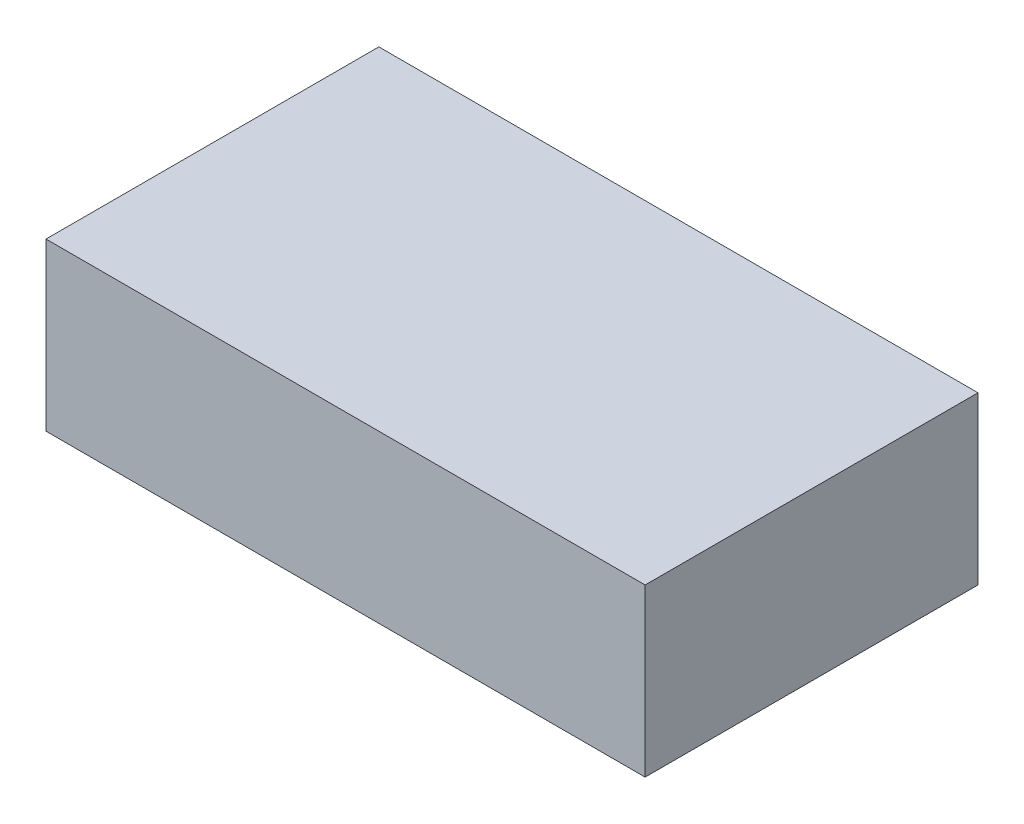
ISO-10303-21;
HEADER;
FILE_DESCRIPTION(('STEP AP214'),'2;1');
FILE_NAME('part.step','',(''),(''),'','','');
FILE_SCHEMA(('AUTOMOTIVE_DESIGN { 1 0 10303 214 1 1 1 1 }'));
ENDSEC;
DATA;
#1=APPLICATION_CONTEXT('core data for automotive mechanical design processes');
#2=APPLICATION_PROTOCOL_DEFINITION('international standard','automotive_design',2000,#1);
#3=PRODUCT_CONTEXT('',#1,'mechanical');
#4=PRODUCT('Part','Part','',(#3));
#5=PRODUCT_RELATED_PRODUCT_CATEGORY('part','',(#4));
#6=PRODUCT_DEFINITION_FORMATION('','',#4);
#7=PRODUCT_DEFINITION_CONTEXT('part definition',#1,'design');
#8=PRODUCT_DEFINITION('design','',#6,#7);
#9=PRODUCT_DEFINITION_SHAPE('','',#8);
#10=(LENGTH_UNIT() NAMED_UNIT(*) SI_UNIT(.MILLI.,.METRE.));
#11=(NAMED_UNIT(*) PLANE_ANGLE_UNIT() SI_UNIT($,.RADIAN.));
#12=(NAMED_UNIT(*) SI_UNIT($,.STERADIAN.) SOLID_ANGLE_UNIT());
#13=UNCERTAINTY_MEASURE_WITH_UNIT(LENGTH_MEASURE(1.E-05),#10,'distance_accuracy_value','');
#14=(GEOMETRIC_REPRESENTATION_CONTEXT(3) GLOBAL_UNCERTAINTY_ASSIGNED_CONTEXT((#13)) GLOBAL_UNIT_ASSIGNED_CONTEXT((#10,
#11,#12)) REPRESENTATION_CONTEXT('',''));
#15=CARTESIAN_POINT('',(0.,0.,0.));
#16=DIRECTION('',(0.,0.,1.));
#17=DIRECTION('',(1.,0.,0.));
#18=AXIS2_PLACEMENT_3D('',#15,#16,#17);
#19=CARTESIAN_POINT('',(0.,-25.,0.));
#20=DIRECTION('',(-1.,0.,0.));
#21=DIRECTION('',(0.,0.,1.));
#22=AXIS2_PLACEMENT_3D('',#19,#20,#21);
#23=PLANE('',#22);
#24=DIRECTION('',(0.,0.,1.));
#25=VECTOR('',#24,1.);
#26=CARTESIAN_POINT('',(0.,0.,0.));
#27=LINE('',#26,#25);
#28=CARTESIAN_POINT('',(0.,0.,-50.));
#29=VERTEX_POINT('',#28);
#30=CARTESIAN_POINT('',(0.,0.,0.));
#31=VERTEX_POINT('',#30);
#32=EDGE_CURVE('E103',#29,#31,#27,.T.);
#33=ORIENTED_EDGE('',*,*,#32,.F.);
#34=DIRECTION('',(0.,1.,0.));
#35=VECTOR('',#34,1.);
#36=CARTESIAN_POINT('',(0.,-25.,-50.));
#37=LINE('',#36,#35);
#38=CARTESIAN_POINT('',(0.,-25.,-50.));
#39=VERTEX_POINT('',#38);
#40=EDGE_CURVE('E11',#39,#29,#37,.T.);
#41=ORIENTED_EDGE('',*,*,#40,.F.);
#42=DIRECTION('',(0.,0.,1.));
#43=VECTOR('',#42,1.);
#44=CARTESIAN_POINT('',(0.,-25.,0.));
#45=LINE('',#44,#43);
#46=CARTESIAN_POINT('',(0.,-25.,0.));
#47=VERTEX_POINT('',#46);
#48=EDGE_CURVE('E100',#39,#47,#45,.T.);
#49=ORIENTED_EDGE('',*,*,#48,.T.);
#50=DIRECTION('',(0.,1.,0.));
#51=VECTOR('',#50,1.);
#52=CARTESIAN_POINT('',(0.,-25.,0.));
#53=LINE('',#52,#51);
#54=EDGE_CURVE('E45',#47,#31,#53,.T.);
#55=ORIENTED_EDGE('',*,*,#54,.T.);
#56=EDGE_LOOP('',(#33,#41,#49,#55));
#57=FACE_BOUND('',#56,.T.);
#58=ADVANCED_FACE('F39',(#57),#23,.T.);
#59=CARTESIAN_POINT('',(0.,-25.,-50.));
#60=DIRECTION('',(0.,0.,-1.));
#61=DIRECTION('',(-1.,0.,0.));
#62=AXIS2_PLACEMENT_3D('',#59,#60,#61);
#63=PLANE('',#62);
#64=DIRECTION('',(-1.,0.,0.));
#65=VECTOR('',#64,1.);
#66=CARTESIAN_POINT('',(0.,0.,-50.));
#67=LINE('',#66,#65);
#68=CARTESIAN_POINT('',(90.,0.,-50.));
#69=VERTEX_POINT('',#68);
#70=EDGE_CURVE('E97',#69,#29,#67,.T.);
#71=ORIENTED_EDGE('',*,*,#70,.F.);
#72=DIRECTION('',(0.,1.,0.));
#73=VECTOR('',#72,1.);
#74=CARTESIAN_POINT('',(90.,-25.,-50.));
#75=LINE('',#74,#73);
#76=CARTESIAN_POINT('',(90.,-25.,-50.));
#77=VERTEX_POINT('',#76);
#78=EDGE_CURVE('E48',#77,#69,#75,.T.);
#79=ORIENTED_EDGE('',*,*,#78,.F.);
#80=DIRECTION('',(-1.,0.,0.));
#81=VECTOR('',#80,1.);
#82=CARTESIAN_POINT('',(0.,-25.,-50.));
#83=LINE('',#82,#81);
#84=EDGE_CURVE('E94',#77,#39,#83,.T.);
#85=ORIENTED_EDGE('',*,*,#84,.T.);
#86=ORIENTED_EDGE('',*,*,#40,.T.);
#87=EDGE_LOOP('',(#71,#79,#85,#86));
#88=FACE_BOUND('',#87,.T.);
#89=ADVANCED_FACE('F114',(#88),#63,.T.);
#90=CARTESIAN_POINT('',(90.,-25.,0.));
#91=DIRECTION('',(1.,0.,0.));
#92=DIRECTION('',(0.,0.,-1.));
#93=AXIS2_PLACEMENT_3D('',#90,#91,#92);
#94=PLANE('',#93);
#95=DIRECTION('',(0.,0.,-1.));
#96=VECTOR('',#95,1.);
#97=CARTESIAN_POINT('',(90.,0.,0.));
#98=LINE('',#97,#96);
#99=CARTESIAN_POINT('',(90.,0.,0.));
#100=VERTEX_POINT('',#99);
#101=EDGE_CURVE('E90',#100,#69,#98,.T.);
#102=ORIENTED_EDGE('',*,*,#101,.F.);
#103=DIRECTION('',(0.,1.,0.));
#104=VECTOR('',#103,1.);
#105=CARTESIAN_POINT('',(90.,-25.,0.));
#106=LINE('',#105,#104);
#107=CARTESIAN_POINT('',(90.,-25.,0.));
#108=VERTEX_POINT('',#107);
#109=EDGE_CURVE('E81',#108,#100,#106,.T.);
#110=ORIENTED_EDGE('',*,*,#109,.F.);
#111=DIRECTION('',(0.,0.,-1.));
#112=VECTOR('',#111,1.);
#113=CARTESIAN_POINT('',(90.,-25.,0.));
#114=LINE('',#113,#112);
#115=EDGE_CURVE('E87',#108,#77,#114,.T.);
#116=ORIENTED_EDGE('',*,*,#115,.T.);
#117=ORIENTED_EDGE('',*,*,#78,.T.);
#118=EDGE_LOOP('',(#102,#110,#116,#117));
#119=FACE_BOUND('',#118,.T.);
#120=ADVANCED_FACE('F88',(#119),#94,.T.);
#121=CARTESIAN_POINT('',(0.,-25.,0.));
#122=DIRECTION('',(0.,0.,1.));
#123=DIRECTION('',(1.,0.,0.));
#124=AXIS2_PLACEMENT_3D('',#121,#122,#123);
#125=PLANE('',#124);
#126=DIRECTION('',(1.,0.,0.));
#127=VECTOR('',#126,1.);
#128=CARTESIAN_POINT('',(0.,0.,0.));
#129=LINE('',#128,#127);
#130=EDGE_CURVE('E106',#31,#100,#129,.T.);
#131=ORIENTED_EDGE('',*,*,#130,.F.);
#132=ORIENTED_EDGE('',*,*,#54,.F.);
#133=DIRECTION('',(1.,0.,0.));
#134=VECTOR('',#133,1.);
#135=CARTESIAN_POINT('',(0.,-25.,0.));
#136=LINE('',#135,#134);
#137=EDGE_CURVE('E91',#47,#108,#136,.T.);
#138=ORIENTED_EDGE('',*,*,#137,.T.);
#139=ORIENTED_EDGE('',*,*,#109,.T.);
#140=EDGE_LOOP('',(#131,#132,#138,#139));
#141=FACE_BOUND('',#140,.T.);
#142=ADVANCED_FACE('F96',(#141),#125,.T.);
#143=CARTESIAN_POINT('',(0.,-25.,0.));
#144=DIRECTION('',(0.,-1.,0.));
#145=DIRECTION('',(0.,0.,-1.));
#146=AXIS2_PLACEMENT_3D('',#143,#144,#145);
#147=PLANE('',#146);
#148=ORIENTED_EDGE('',*,*,#48,.F.);
#149=ORIENTED_EDGE('',*,*,#84,.F.);
#150=ORIENTED_EDGE('',*,*,#115,.F.);
#151=ORIENTED_EDGE('',*,*,#137,.F.);
#152=EDGE_LOOP('',(#148,#149,#150,#151));
#153=FACE_BOUND('',#152,.T.);
#154=ADVANCED_FACE('F95',(#153),#147,.T.);
#155=CARTESIAN_POINT('',(0.,0.,0.));
#156=DIRECTION('',(0.,-1.,0.));
#157=DIRECTION('',(0.,0.,-1.));
#158=AXIS2_PLACEMENT_3D('',#155,#156,#157);
#159=PLANE('',#158);
#160=ORIENTED_EDGE('',*,*,#32,.T.);
#161=ORIENTED_EDGE('',*,*,#130,.T.);
#162=ORIENTED_EDGE('',*,*,#101,.T.);
#163=ORIENTED_EDGE('',*,*,#70,.T.);
#164=EDGE_LOOP('',(#160,#161,#162,#163));
#165=FACE_BOUND('',#164,.T.);
#166=ADVANCED_FACE('F115',(#165),#159,.F.);
#167=CLOSED_SHELL('',(#58,#89,#120,#142,#154,#166));
#168=MANIFOLD_SOLID_BREP('B2',#167);
#169=ADVANCED_BREP_SHAPE_REPRESENTATION('',(#18,#168),#14);
#170=SHAPE_DEFINITION_REPRESENTATION(#9,#169);
ENDSEC;
END-ISO-10303-21;
